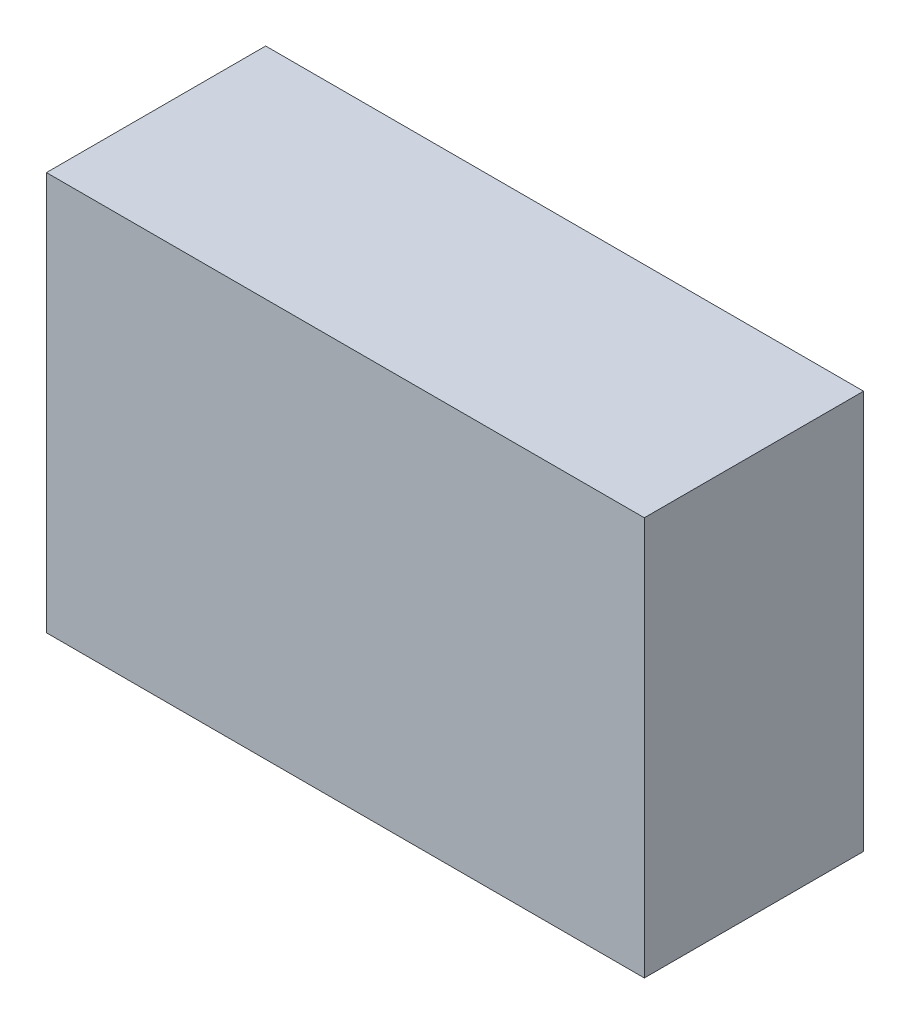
ISO-10303-21;
HEADER;
FILE_DESCRIPTION(('STEP AP214'),'2;1');
FILE_NAME('part.step','',(''),(''),'','','');
FILE_SCHEMA(('AUTOMOTIVE_DESIGN { 1 0 10303 214 1 1 1 1 }'));
ENDSEC;
DATA;
#1=APPLICATION_CONTEXT('core data for automotive mechanical design processes');
#2=APPLICATION_PROTOCOL_DEFINITION('international standard','automotive_design',2000,#1);
#3=PRODUCT_CONTEXT('',#1,'mechanical');
#4=PRODUCT('Part','Part','',(#3));
#5=PRODUCT_RELATED_PRODUCT_CATEGORY('part','',(#4));
#6=PRODUCT_DEFINITION_FORMATION('','',#4);
#7=PRODUCT_DEFINITION_CONTEXT('part definition',#1,'design');
#8=PRODUCT_DEFINITION('design','',#6,#7);
#9=PRODUCT_DEFINITION_SHAPE('','',#8);
#10=(LENGTH_UNIT() NAMED_UNIT(*) SI_UNIT(.MILLI.,.METRE.));
#11=(NAMED_UNIT(*) PLANE_ANGLE_UNIT() SI_UNIT($,.RADIAN.));
#12=(NAMED_UNIT(*) SI_UNIT($,.STERADIAN.) SOLID_ANGLE_UNIT());
#13=UNCERTAINTY_MEASURE_WITH_UNIT(LENGTH_MEASURE(1.E-05),#10,'distance_accuracy_value','');
#14=(GEOMETRIC_REPRESENTATION_CONTEXT(3) GLOBAL_UNCERTAINTY_ASSIGNED_CONTEXT((#13)) GLOBAL_UNIT_ASSIGNED_CONTEXT((#10,
#11,#12)) REPRESENTATION_CONTEXT('',''));
#15=CARTESIAN_POINT('',(0.,0.,0.));
#16=DIRECTION('',(0.,0.,1.));
#17=DIRECTION('',(1.,0.,0.));
#18=AXIS2_PLACEMENT_3D('',#15,#16,#17);
#19=CARTESIAN_POINT('',(0.,0.,55.));
#20=DIRECTION('',(1.,0.,0.));
#21=DIRECTION('',(0.,0.,-1.));
#22=AXIS2_PLACEMENT_3D('',#19,#20,#21);
#23=PLANE('',#22);
#24=DIRECTION('',(0.,-1.,0.));
#25=VECTOR('',#24,1.);
#26=CARTESIAN_POINT('',(0.,0.,0.));
#27=LINE('',#26,#25);
#28=CARTESIAN_POINT('',(0.,100.,0.));
#29=VERTEX_POINT('',#28);
#30=CARTESIAN_POINT('',(0.,0.,0.));
#31=VERTEX_POINT('',#30);
#32=EDGE_CURVE('E96',#29,#31,#27,.T.);
#33=ORIENTED_EDGE('',*,*,#32,.T.);
#34=DIRECTION('',(0.,0.,-1.));
#35=VECTOR('',#34,1.);
#36=CARTESIAN_POINT('',(0.,0.,55.));
#37=LINE('',#36,#35);
#38=CARTESIAN_POINT('',(0.,0.,55.));
#39=VERTEX_POINT('',#38);
#40=EDGE_CURVE('E11',#39,#31,#37,.T.);
#41=ORIENTED_EDGE('',*,*,#40,.F.);
#42=DIRECTION('',(0.,-1.,0.));
#43=VECTOR('',#42,1.);
#44=CARTESIAN_POINT('',(0.,0.,55.));
#45=LINE('',#44,#43);
#46=CARTESIAN_POINT('',(0.,100.,55.));
#47=VERTEX_POINT('',#46);
#48=EDGE_CURVE('E84',#47,#39,#45,.T.);
#49=ORIENTED_EDGE('',*,*,#48,.F.);
#50=DIRECTION('',(0.,0.,-1.));
#51=VECTOR('',#50,1.);
#52=CARTESIAN_POINT('',(0.,100.,55.));
#53=LINE('',#52,#51);
#54=EDGE_CURVE('E92',#47,#29,#53,.T.);
#55=ORIENTED_EDGE('',*,*,#54,.T.);
#56=EDGE_LOOP('',(#33,#41,#49,#55));
#57=FACE_BOUND('',#56,.T.);
#58=ADVANCED_FACE('F33',(#57),#23,.F.);
#59=CARTESIAN_POINT('',(0.,0.,55.));
#60=DIRECTION('',(0.,1.,0.));
#61=DIRECTION('',(0.,0.,1.));
#62=AXIS2_PLACEMENT_3D('',#59,#60,#61);
#63=PLANE('',#62);
#64=DIRECTION('',(1.,0.,0.));
#65=VECTOR('',#64,1.);
#66=CARTESIAN_POINT('',(0.,0.,0.));
#67=LINE('',#66,#65);
#68=CARTESIAN_POINT('',(150.,0.,0.));
#69=VERTEX_POINT('',#68);
#70=EDGE_CURVE('E88',#31,#69,#67,.T.);
#71=ORIENTED_EDGE('',*,*,#70,.T.);
#72=DIRECTION('',(0.,0.,-1.));
#73=VECTOR('',#72,1.);
#74=CARTESIAN_POINT('',(150.,0.,55.));
#75=LINE('',#74,#73);
#76=CARTESIAN_POINT('',(150.,0.,55.));
#77=VERTEX_POINT('',#76);
#78=EDGE_CURVE('E41',#77,#69,#75,.T.);
#79=ORIENTED_EDGE('',*,*,#78,.F.);
#80=DIRECTION('',(1.,0.,0.));
#81=VECTOR('',#80,1.);
#82=CARTESIAN_POINT('',(0.,0.,55.));
#83=LINE('',#82,#81);
#84=EDGE_CURVE('E79',#39,#77,#83,.T.);
#85=ORIENTED_EDGE('',*,*,#84,.F.);
#86=ORIENTED_EDGE('',*,*,#40,.T.);
#87=EDGE_LOOP('',(#71,#79,#85,#86));
#88=FACE_BOUND('',#87,.T.);
#89=ADVANCED_FACE('F87',(#88),#63,.F.);
#90=CARTESIAN_POINT('',(150.,0.,55.));
#91=DIRECTION('',(-1.,0.,0.));
#92=DIRECTION('',(0.,0.,1.));
#93=AXIS2_PLACEMENT_3D('',#90,#91,#92);
#94=PLANE('',#93);
#95=DIRECTION('',(0.,1.,0.));
#96=VECTOR('',#95,1.);
#97=CARTESIAN_POINT('',(150.,0.,0.));
#98=LINE('',#97,#96);
#99=CARTESIAN_POINT('',(150.,100.,0.));
#100=VERTEX_POINT('',#99);
#101=EDGE_CURVE('E66',#69,#100,#98,.T.);
#102=ORIENTED_EDGE('',*,*,#101,.T.);
#103=DIRECTION('',(0.,0.,-1.));
#104=VECTOR('',#103,1.);
#105=CARTESIAN_POINT('',(150.,100.,55.));
#106=LINE('',#105,#104);
#107=CARTESIAN_POINT('',(150.,100.,55.));
#108=VERTEX_POINT('',#107);
#109=EDGE_CURVE('E89',#108,#100,#106,.T.);
#110=ORIENTED_EDGE('',*,*,#109,.F.);
#111=DIRECTION('',(0.,1.,0.));
#112=VECTOR('',#111,1.);
#113=CARTESIAN_POINT('',(150.,0.,55.));
#114=LINE('',#113,#112);
#115=EDGE_CURVE('E82',#77,#108,#114,.T.);
#116=ORIENTED_EDGE('',*,*,#115,.F.);
#117=ORIENTED_EDGE('',*,*,#78,.T.);
#118=EDGE_LOOP('',(#102,#110,#116,#117));
#119=FACE_BOUND('',#118,.T.);
#120=ADVANCED_FACE('F90',(#119),#94,.F.);
#121=CARTESIAN_POINT('',(0.,100.,55.));
#122=DIRECTION('',(0.,-1.,0.));
#123=DIRECTION('',(0.,0.,-1.));
#124=AXIS2_PLACEMENT_3D('',#121,#122,#123);
#125=PLANE('',#124);
#126=DIRECTION('',(-1.,0.,0.));
#127=VECTOR('',#126,1.);
#128=CARTESIAN_POINT('',(0.,100.,0.));
#129=LINE('',#128,#127);
#130=EDGE_CURVE('E72',#100,#29,#129,.T.);
#131=ORIENTED_EDGE('',*,*,#130,.T.);
#132=ORIENTED_EDGE('',*,*,#54,.F.);
#133=DIRECTION('',(-1.,0.,0.));
#134=VECTOR('',#133,1.);
#135=CARTESIAN_POINT('',(0.,100.,55.));
#136=LINE('',#135,#134);
#137=EDGE_CURVE('E49',#108,#47,#136,.T.);
#138=ORIENTED_EDGE('',*,*,#137,.F.);
#139=ORIENTED_EDGE('',*,*,#109,.T.);
#140=EDGE_LOOP('',(#131,#132,#138,#139));
#141=FACE_BOUND('',#140,.T.);
#142=ADVANCED_FACE('F103',(#141),#125,.F.);
#143=CARTESIAN_POINT('',(0.,0.,55.));
#144=DIRECTION('',(0.,0.,-1.));
#145=DIRECTION('',(-1.,0.,0.));
#146=AXIS2_PLACEMENT_3D('',#143,#144,#145);
#147=PLANE('',#146);
#148=ORIENTED_EDGE('',*,*,#48,.T.);
#149=ORIENTED_EDGE('',*,*,#84,.T.);
#150=ORIENTED_EDGE('',*,*,#115,.T.);
#151=ORIENTED_EDGE('',*,*,#137,.T.);
#152=EDGE_LOOP('',(#148,#149,#150,#151));
#153=FACE_BOUND('',#152,.T.);
#154=ADVANCED_FACE('F80',(#153),#147,.F.);
#155=CARTESIAN_POINT('',(0.,0.,0.));
#156=DIRECTION('',(0.,0.,-1.));
#157=DIRECTION('',(-1.,0.,0.));
#158=AXIS2_PLACEMENT_3D('',#155,#156,#157);
#159=PLANE('',#158);
#160=ORIENTED_EDGE('',*,*,#32,.F.);
#161=ORIENTED_EDGE('',*,*,#130,.F.);
#162=ORIENTED_EDGE('',*,*,#101,.F.);
#163=ORIENTED_EDGE('',*,*,#70,.F.);
#164=EDGE_LOOP('',(#160,#161,#162,#163));
#165=FACE_BOUND('',#164,.T.);
#166=ADVANCED_FACE('F106',(#165),#159,.T.);
#167=CLOSED_SHELL('',(#58,#89,#120,#142,#154,#166));
#168=MANIFOLD_SOLID_BREP('B2',#167);
#169=ADVANCED_BREP_SHAPE_REPRESENTATION('',(#18,#168),#14);
#170=SHAPE_DEFINITION_REPRESENTATION(#9,#169);
ENDSEC;
END-ISO-10303-21;
